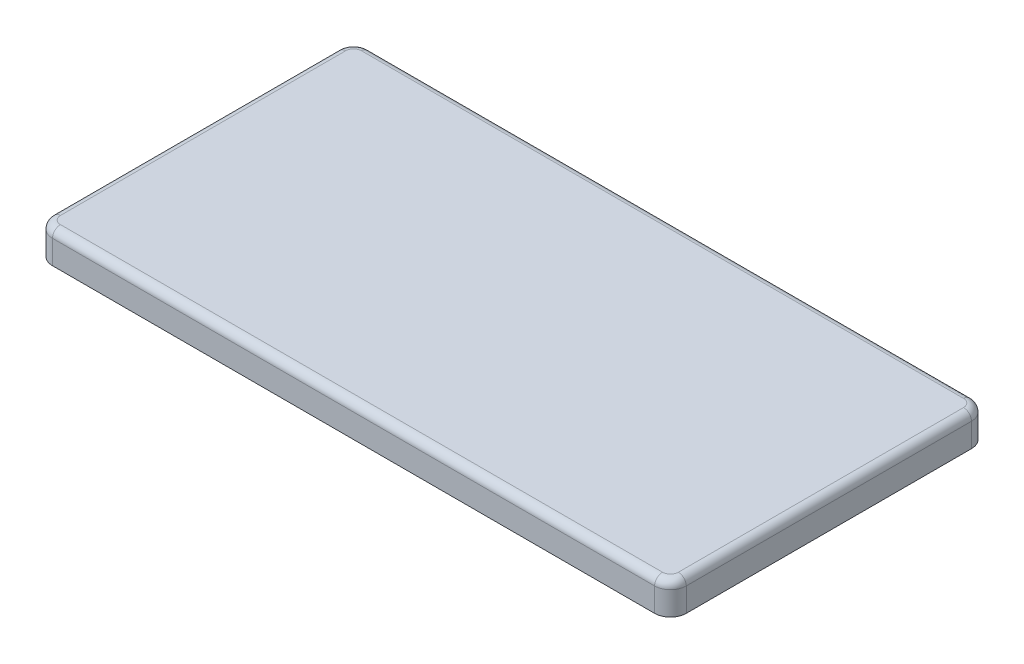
ISO-10303-21;
HEADER;
FILE_DESCRIPTION(('STEP AP214'),'2;1');
FILE_NAME('part.step','',(''),(''),'','','');
FILE_SCHEMA(('AUTOMOTIVE_DESIGN { 1 0 10303 214 1 1 1 1 }'));
ENDSEC;
DATA;
#1=APPLICATION_CONTEXT('core data for automotive mechanical design processes');
#2=APPLICATION_PROTOCOL_DEFINITION('international standard','automotive_design',2000,#1);
#3=PRODUCT_CONTEXT('',#1,'mechanical');
#4=PRODUCT('Part','Part','',(#3));
#5=PRODUCT_RELATED_PRODUCT_CATEGORY('part','',(#4));
#6=PRODUCT_DEFINITION_FORMATION('','',#4);
#7=PRODUCT_DEFINITION_CONTEXT('part definition',#1,'design');
#8=PRODUCT_DEFINITION('design','',#6,#7);
#9=PRODUCT_DEFINITION_SHAPE('','',#8);
#10=(LENGTH_UNIT() NAMED_UNIT(*) SI_UNIT(.MILLI.,.METRE.));
#11=(NAMED_UNIT(*) PLANE_ANGLE_UNIT() SI_UNIT($,.RADIAN.));
#12=(NAMED_UNIT(*) SI_UNIT($,.STERADIAN.) SOLID_ANGLE_UNIT());
#13=UNCERTAINTY_MEASURE_WITH_UNIT(LENGTH_MEASURE(1.E-05),#10,'distance_accuracy_value','');
#14=(GEOMETRIC_REPRESENTATION_CONTEXT(3) GLOBAL_UNCERTAINTY_ASSIGNED_CONTEXT((#13)) GLOBAL_UNIT_ASSIGNED_CONTEXT((#10,
#11,#12)) REPRESENTATION_CONTEXT('',''));
#15=CARTESIAN_POINT('',(0.,0.,0.));
#16=DIRECTION('',(0.,0.,1.));
#17=DIRECTION('',(1.,0.,0.));
#18=AXIS2_PLACEMENT_3D('',#15,#16,#17);
#19=CARTESIAN_POINT('',(-37.2,0.,17.2));
#20=DIRECTION('',(0.,-1.,0.));
#21=DIRECTION('',(0.,0.,-1.));
#22=AXIS2_PLACEMENT_3D('',#19,#20,#21);
#23=PLANE('',#22);
#24=DIRECTION('',(1.,0.,0.));
#25=VECTOR('',#24,1.);
#26=CARTESIAN_POINT('',(-22.15,0.,-3.15));
#27=LINE('',#26,#25);
#28=CARTESIAN_POINT('',(-22.15,0.,-3.15));
#29=VERTEX_POINT('',#28);
#30=CARTESIAN_POINT('',(-17.85,0.,-3.15));
#31=VERTEX_POINT('',#30);
#32=EDGE_CURVE('E282',#29,#31,#27,.T.);
#33=ORIENTED_EDGE('',*,*,#32,.F.);
#34=DIRECTION('',(0.,0.,-1.));
#35=VECTOR('',#34,1.);
#36=CARTESIAN_POINT('',(-22.15,0.,3.15));
#37=LINE('',#36,#35);
#38=CARTESIAN_POINT('',(-22.15,0.,3.15));
#39=VERTEX_POINT('',#38);
#40=EDGE_CURVE('E256',#39,#29,#37,.T.);
#41=ORIENTED_EDGE('',*,*,#40,.F.);
#42=DIRECTION('',(-1.,0.,0.));
#43=VECTOR('',#42,1.);
#44=CARTESIAN_POINT('',(-22.15,0.,3.15));
#45=LINE('',#44,#43);
#46=CARTESIAN_POINT('',(-17.85,0.,3.15));
#47=VERTEX_POINT('',#46);
#48=EDGE_CURVE('E288',#47,#39,#45,.T.);
#49=ORIENTED_EDGE('',*,*,#48,.F.);
#50=DIRECTION('',(0.,0.,1.));
#51=VECTOR('',#50,1.);
#52=CARTESIAN_POINT('',(-17.85,0.,3.15));
#53=LINE('',#52,#51);
#54=EDGE_CURVE('E285',#31,#47,#53,.T.);
#55=ORIENTED_EDGE('',*,*,#54,.F.);
#56=EDGE_LOOP('',(#33,#41,#49,#55));
#57=FACE_BOUND('',#56,.T.);
#58=CARTESIAN_POINT('',(-37.2,0.,17.2));
#59=DIRECTION('',(0.,-1.,0.));
#60=DIRECTION('',(0.,0.,-1.));
#61=AXIS2_PLACEMENT_3D('',#58,#59,#60);
#62=CIRCLE('',#61,0.800000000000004);
#63=CARTESIAN_POINT('',(-37.2,0.,18.));
#64=VERTEX_POINT('',#63);
#65=CARTESIAN_POINT('',(-38.,0.,17.2));
#66=VERTEX_POINT('',#65);
#67=EDGE_CURVE('E300',#64,#66,#62,.T.);
#68=ORIENTED_EDGE('',*,*,#67,.T.);
#69=DIRECTION('',(0.,0.,-1.));
#70=VECTOR('',#69,1.);
#71=CARTESIAN_POINT('',(-38.,0.,17.2));
#72=LINE('',#71,#70);
#73=CARTESIAN_POINT('',(-38.,0.,-17.2));
#74=VERTEX_POINT('',#73);
#75=EDGE_CURVE('E303',#66,#74,#72,.T.);
#76=ORIENTED_EDGE('',*,*,#75,.T.);
#77=CARTESIAN_POINT('',(-37.2,0.,-17.2));
#78=DIRECTION('',(0.,-1.,0.));
#79=DIRECTION('',(0.,0.,-1.));
#80=AXIS2_PLACEMENT_3D('',#77,#78,#79);
#81=CIRCLE('',#80,0.799999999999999);
#82=CARTESIAN_POINT('',(-37.2,0.,-18.));
#83=VERTEX_POINT('',#82);
#84=EDGE_CURVE('E307',#74,#83,#81,.T.);
#85=ORIENTED_EDGE('',*,*,#84,.T.);
#86=DIRECTION('',(1.,0.,0.));
#87=VECTOR('',#86,1.);
#88=CARTESIAN_POINT('',(-37.2,0.,-18.));
#89=LINE('',#88,#87);
#90=CARTESIAN_POINT('',(37.2,0.,-18.));
#91=VERTEX_POINT('',#90);
#92=EDGE_CURVE('E310',#83,#91,#89,.T.);
#93=ORIENTED_EDGE('',*,*,#92,.T.);
#94=CARTESIAN_POINT('',(37.2,0.,-17.2));
#95=DIRECTION('',(0.,-1.,0.));
#96=DIRECTION('',(0.,0.,-1.));
#97=AXIS2_PLACEMENT_3D('',#94,#95,#96);
#98=CIRCLE('',#97,0.799999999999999);
#99=CARTESIAN_POINT('',(38.,0.,-17.2));
#100=VERTEX_POINT('',#99);
#101=EDGE_CURVE('E313',#91,#100,#98,.T.);
#102=ORIENTED_EDGE('',*,*,#101,.T.);
#103=DIRECTION('',(0.,0.,1.));
#104=VECTOR('',#103,1.);
#105=CARTESIAN_POINT('',(38.,0.,17.2));
#106=LINE('',#105,#104);
#107=CARTESIAN_POINT('',(38.,0.,17.2));
#108=VERTEX_POINT('',#107);
#109=EDGE_CURVE('E316',#100,#108,#106,.T.);
#110=ORIENTED_EDGE('',*,*,#109,.T.);
#111=CARTESIAN_POINT('',(37.2,0.,17.2));
#112=DIRECTION('',(0.,-1.,0.));
#113=DIRECTION('',(0.,0.,-1.));
#114=AXIS2_PLACEMENT_3D('',#111,#112,#113);
#115=CIRCLE('',#114,0.799999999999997);
#116=CARTESIAN_POINT('',(37.2,0.,18.));
#117=VERTEX_POINT('',#116);
#118=EDGE_CURVE('E319',#108,#117,#115,.T.);
#119=ORIENTED_EDGE('',*,*,#118,.T.);
#120=DIRECTION('',(-1.,0.,0.));
#121=VECTOR('',#120,1.);
#122=CARTESIAN_POINT('',(-37.2,0.,18.));
#123=LINE('',#122,#121);
#124=EDGE_CURVE('E322',#117,#64,#123,.T.);
#125=ORIENTED_EDGE('',*,*,#124,.T.);
#126=EDGE_LOOP('',(#68,#76,#85,#93,#102,#110,#119,#125));
#127=FACE_BOUND('',#126,.T.);
#128=DIRECTION('',(1.,0.,0.));
#129=VECTOR('',#128,1.);
#130=CARTESIAN_POINT('',(17.85,0.,-3.15));
#131=LINE('',#130,#129);
#132=CARTESIAN_POINT('',(17.85,0.,-3.15));
#133=VERTEX_POINT('',#132);
#134=CARTESIAN_POINT('',(22.15,0.,-3.15));
#135=VERTEX_POINT('',#134);
#136=EDGE_CURVE('E250',#133,#135,#131,.T.);
#137=ORIENTED_EDGE('',*,*,#136,.F.);
#138=DIRECTION('',(0.,0.,-1.));
#139=VECTOR('',#138,1.);
#140=CARTESIAN_POINT('',(17.85,0.,3.15));
#141=LINE('',#140,#139);
#142=CARTESIAN_POINT('',(17.85,0.,3.15));
#143=VERTEX_POINT('',#142);
#144=EDGE_CURVE('E260',#143,#133,#141,.T.);
#145=ORIENTED_EDGE('',*,*,#144,.F.);
#146=DIRECTION('',(-1.,0.,0.));
#147=VECTOR('',#146,1.);
#148=CARTESIAN_POINT('',(17.85,0.,3.15));
#149=LINE('',#148,#147);
#150=CARTESIAN_POINT('',(22.15,0.,3.15));
#151=VERTEX_POINT('',#150);
#152=EDGE_CURVE('E272',#151,#143,#149,.T.);
#153=ORIENTED_EDGE('',*,*,#152,.F.);
#154=DIRECTION('',(0.,0.,1.));
#155=VECTOR('',#154,1.);
#156=CARTESIAN_POINT('',(22.15,0.,3.15));
#157=LINE('',#156,#155);
#158=EDGE_CURVE('E270',#135,#151,#157,.T.);
#159=ORIENTED_EDGE('',*,*,#158,.F.);
#160=EDGE_LOOP('',(#137,#145,#153,#159));
#161=FACE_BOUND('',#160,.T.);
#162=ADVANCED_FACE('F35',(#57,#127,#161),#23,.T.);
#163=CARTESIAN_POINT('',(-38.,2.,-18.));
#164=DIRECTION('',(0.,-1.,0.));
#165=DIRECTION('',(0.,0.,-1.));
#166=AXIS2_PLACEMENT_3D('',#163,#164,#165);
#167=CYLINDRICAL_SURFACE('',#166,2.);
#168=DIRECTION('',(0.,-1.,0.));
#169=VECTOR('',#168,1.);
#170=CARTESIAN_POINT('',(-40.,2.,-18.));
#171=LINE('',#170,#169);
#172=CARTESIAN_POINT('',(-40.,1.,-18.));
#173=VERTEX_POINT('',#172);
#174=CARTESIAN_POINT('',(-40.,-2.,-18.));
#175=VERTEX_POINT('',#174);
#176=EDGE_CURVE('E403',#173,#175,#171,.T.);
#177=ORIENTED_EDGE('',*,*,#176,.F.);
#178=CARTESIAN_POINT('',(-38.,1.,-18.));
#179=DIRECTION('',(0.,1.,0.));
#180=DIRECTION('',(0.,0.,1.));
#181=AXIS2_PLACEMENT_3D('',#178,#179,#180);
#182=CIRCLE('',#181,2.);
#183=CARTESIAN_POINT('',(-38.,1.,-20.));
#184=VERTEX_POINT('',#183);
#185=EDGE_CURVE('E427',#173,#184,#182,.F.);
#186=ORIENTED_EDGE('',*,*,#185,.T.);
#187=DIRECTION('',(0.,-1.,0.));
#188=VECTOR('',#187,1.);
#189=CARTESIAN_POINT('',(-38.,2.,-20.));
#190=LINE('',#189,#188);
#191=CARTESIAN_POINT('',(-38.,-2.,-20.));
#192=VERTEX_POINT('',#191);
#193=EDGE_CURVE('E389',#184,#192,#190,.T.);
#194=ORIENTED_EDGE('',*,*,#193,.T.);
#195=CARTESIAN_POINT('',(-38.,-2.,-18.));
#196=DIRECTION('',(0.,1.,0.));
#197=DIRECTION('',(0.,0.,1.));
#198=AXIS2_PLACEMENT_3D('',#195,#196,#197);
#199=CIRCLE('',#198,2.);
#200=EDGE_CURVE('E364',#192,#175,#199,.T.);
#201=ORIENTED_EDGE('',*,*,#200,.T.);
#202=EDGE_LOOP('',(#177,#186,#194,#201));
#203=FACE_BOUND('',#202,.T.);
#204=ADVANCED_FACE('F543',(#203),#167,.T.);
#205=CARTESIAN_POINT('',(-40.,2.,18.));
#206=DIRECTION('',(1.,0.,0.));
#207=DIRECTION('',(0.,0.,-1.));
#208=AXIS2_PLACEMENT_3D('',#205,#206,#207);
#209=PLANE('',#208);
#210=DIRECTION('',(0.,-1.,0.));
#211=VECTOR('',#210,1.);
#212=CARTESIAN_POINT('',(-40.,2.,18.));
#213=LINE('',#212,#211);
#214=CARTESIAN_POINT('',(-40.,1.,18.));
#215=VERTEX_POINT('',#214);
#216=CARTESIAN_POINT('',(-40.,-2.,18.));
#217=VERTEX_POINT('',#216);
#218=EDGE_CURVE('E401',#215,#217,#213,.T.);
#219=ORIENTED_EDGE('',*,*,#218,.F.);
#220=DIRECTION('',(0.,0.,1.));
#221=VECTOR('',#220,1.);
#222=CARTESIAN_POINT('',(-40.,1.,-18.));
#223=LINE('',#222,#221);
#224=EDGE_CURVE('E425',#215,#173,#223,.F.);
#225=ORIENTED_EDGE('',*,*,#224,.T.);
#226=ORIENTED_EDGE('',*,*,#176,.T.);
#227=DIRECTION('',(0.,0.,1.));
#228=VECTOR('',#227,1.);
#229=CARTESIAN_POINT('',(-40.,-2.,18.));
#230=LINE('',#229,#228);
#231=EDGE_CURVE('E367',#175,#217,#230,.T.);
#232=ORIENTED_EDGE('',*,*,#231,.T.);
#233=EDGE_LOOP('',(#219,#225,#226,#232));
#234=FACE_BOUND('',#233,.T.);
#235=ADVANCED_FACE('F549',(#234),#209,.F.);
#236=CARTESIAN_POINT('',(-38.,2.,18.));
#237=DIRECTION('',(0.,-1.,0.));
#238=DIRECTION('',(0.,0.,-1.));
#239=AXIS2_PLACEMENT_3D('',#236,#237,#238);
#240=CYLINDRICAL_SURFACE('',#239,2.);
#241=DIRECTION('',(0.,-1.,0.));
#242=VECTOR('',#241,1.);
#243=CARTESIAN_POINT('',(-38.,2.,20.));
#244=LINE('',#243,#242);
#245=CARTESIAN_POINT('',(-38.,1.,20.));
#246=VERTEX_POINT('',#245);
#247=CARTESIAN_POINT('',(-38.,-2.,20.));
#248=VERTEX_POINT('',#247);
#249=EDGE_CURVE('E399',#246,#248,#244,.T.);
#250=ORIENTED_EDGE('',*,*,#249,.F.);
#251=CARTESIAN_POINT('',(-38.,1.,18.));
#252=DIRECTION('',(0.,1.,0.));
#253=DIRECTION('',(0.,0.,1.));
#254=AXIS2_PLACEMENT_3D('',#251,#252,#253);
#255=CIRCLE('',#254,2.);
#256=EDGE_CURVE('E422',#246,#215,#255,.F.);
#257=ORIENTED_EDGE('',*,*,#256,.T.);
#258=ORIENTED_EDGE('',*,*,#218,.T.);
#259=CARTESIAN_POINT('',(-38.,-2.,18.));
#260=DIRECTION('',(0.,1.,0.));
#261=DIRECTION('',(0.,0.,1.));
#262=AXIS2_PLACEMENT_3D('',#259,#260,#261);
#263=CIRCLE('',#262,2.);
#264=EDGE_CURVE('E371',#217,#248,#263,.T.);
#265=ORIENTED_EDGE('',*,*,#264,.T.);
#266=EDGE_LOOP('',(#250,#257,#258,#265));
#267=FACE_BOUND('',#266,.T.);
#268=ADVANCED_FACE('F619',(#267),#240,.T.);
#269=CARTESIAN_POINT('',(-38.,2.,20.));
#270=DIRECTION('',(0.,0.,-1.));
#271=DIRECTION('',(-1.,0.,0.));
#272=AXIS2_PLACEMENT_3D('',#269,#270,#271);
#273=PLANE('',#272);
#274=DIRECTION('',(0.,-1.,0.));
#275=VECTOR('',#274,1.);
#276=CARTESIAN_POINT('',(38.,2.,20.));
#277=LINE('',#276,#275);
#278=CARTESIAN_POINT('',(38.,1.,20.));
#279=VERTEX_POINT('',#278);
#280=CARTESIAN_POINT('',(38.,-2.,20.));
#281=VERTEX_POINT('',#280);
#282=EDGE_CURVE('E397',#279,#281,#277,.T.);
#283=ORIENTED_EDGE('',*,*,#282,.F.);
#284=DIRECTION('',(1.,0.,0.));
#285=VECTOR('',#284,1.);
#286=CARTESIAN_POINT('',(-38.,1.,20.));
#287=LINE('',#286,#285);
#288=EDGE_CURVE('E437',#279,#246,#287,.F.);
#289=ORIENTED_EDGE('',*,*,#288,.T.);
#290=ORIENTED_EDGE('',*,*,#249,.T.);
#291=DIRECTION('',(1.,0.,0.));
#292=VECTOR('',#291,1.);
#293=CARTESIAN_POINT('',(-38.,-2.,20.));
#294=LINE('',#293,#292);
#295=EDGE_CURVE('E374',#248,#281,#294,.T.);
#296=ORIENTED_EDGE('',*,*,#295,.T.);
#297=EDGE_LOOP('',(#283,#289,#290,#296));
#298=FACE_BOUND('',#297,.T.);
#299=ADVANCED_FACE('F615',(#298),#273,.F.);
#300=CARTESIAN_POINT('',(38.,2.,18.));
#301=DIRECTION('',(0.,-1.,0.));
#302=DIRECTION('',(0.,0.,-1.));
#303=AXIS2_PLACEMENT_3D('',#300,#301,#302);
#304=CYLINDRICAL_SURFACE('',#303,2.);
#305=DIRECTION('',(0.,-1.,0.));
#306=VECTOR('',#305,1.);
#307=CARTESIAN_POINT('',(40.,2.,18.));
#308=LINE('',#307,#306);
#309=CARTESIAN_POINT('',(40.,1.,18.));
#310=VERTEX_POINT('',#309);
#311=CARTESIAN_POINT('',(40.,-2.,18.));
#312=VERTEX_POINT('',#311);
#313=EDGE_CURVE('E395',#310,#312,#308,.T.);
#314=ORIENTED_EDGE('',*,*,#313,.F.);
#315=CARTESIAN_POINT('',(38.,1.,18.));
#316=DIRECTION('',(0.,1.,0.));
#317=DIRECTION('',(0.,0.,1.));
#318=AXIS2_PLACEMENT_3D('',#315,#316,#317);
#319=CIRCLE('',#318,2.);
#320=EDGE_CURVE('E435',#310,#279,#319,.F.);
#321=ORIENTED_EDGE('',*,*,#320,.T.);
#322=ORIENTED_EDGE('',*,*,#282,.T.);
#323=CARTESIAN_POINT('',(38.,-2.,18.));
#324=DIRECTION('',(0.,1.,0.));
#325=DIRECTION('',(0.,0.,1.));
#326=AXIS2_PLACEMENT_3D('',#323,#324,#325);
#327=CIRCLE('',#326,2.);
#328=EDGE_CURVE('E377',#281,#312,#327,.T.);
#329=ORIENTED_EDGE('',*,*,#328,.T.);
#330=EDGE_LOOP('',(#314,#321,#322,#329));
#331=FACE_BOUND('',#330,.T.);
#332=ADVANCED_FACE('F611',(#331),#304,.T.);
#333=CARTESIAN_POINT('',(40.,2.,18.));
#334=DIRECTION('',(-1.,0.,0.));
#335=DIRECTION('',(0.,0.,1.));
#336=AXIS2_PLACEMENT_3D('',#333,#334,#335);
#337=PLANE('',#336);
#338=DIRECTION('',(0.,-1.,0.));
#339=VECTOR('',#338,1.);
#340=CARTESIAN_POINT('',(40.,2.,-18.));
#341=LINE('',#340,#339);
#342=CARTESIAN_POINT('',(40.,1.,-18.));
#343=VERTEX_POINT('',#342);
#344=CARTESIAN_POINT('',(40.,-2.,-18.));
#345=VERTEX_POINT('',#344);
#346=EDGE_CURVE('E393',#343,#345,#341,.T.);
#347=ORIENTED_EDGE('',*,*,#346,.F.);
#348=DIRECTION('',(0.,0.,-1.));
#349=VECTOR('',#348,1.);
#350=CARTESIAN_POINT('',(40.,1.,18.));
#351=LINE('',#350,#349);
#352=EDGE_CURVE('E433',#343,#310,#351,.F.);
#353=ORIENTED_EDGE('',*,*,#352,.T.);
#354=ORIENTED_EDGE('',*,*,#313,.T.);
#355=DIRECTION('',(0.,0.,-1.));
#356=VECTOR('',#355,1.);
#357=CARTESIAN_POINT('',(40.,-2.,18.));
#358=LINE('',#357,#356);
#359=EDGE_CURVE('E380',#312,#345,#358,.T.);
#360=ORIENTED_EDGE('',*,*,#359,.T.);
#361=EDGE_LOOP('',(#347,#353,#354,#360));
#362=FACE_BOUND('',#361,.T.);
#363=ADVANCED_FACE('F607',(#362),#337,.F.);
#364=CARTESIAN_POINT('',(38.,2.,-18.));
#365=DIRECTION('',(0.,-1.,0.));
#366=DIRECTION('',(0.,0.,-1.));
#367=AXIS2_PLACEMENT_3D('',#364,#365,#366);
#368=CYLINDRICAL_SURFACE('',#367,2.00000000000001);
#369=DIRECTION('',(0.,-1.,0.));
#370=VECTOR('',#369,1.);
#371=CARTESIAN_POINT('',(38.,2.,-20.));
#372=LINE('',#371,#370);
#373=CARTESIAN_POINT('',(38.,1.,-20.));
#374=VERTEX_POINT('',#373);
#375=CARTESIAN_POINT('',(38.,-2.,-20.));
#376=VERTEX_POINT('',#375);
#377=EDGE_CURVE('E391',#374,#376,#372,.T.);
#378=ORIENTED_EDGE('',*,*,#377,.F.);
#379=CARTESIAN_POINT('',(38.,1.,-18.));
#380=DIRECTION('',(0.,1.,0.));
#381=DIRECTION('',(0.,0.,1.));
#382=AXIS2_PLACEMENT_3D('',#379,#380,#381);
#383=CIRCLE('',#382,2.00000000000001);
#384=EDGE_CURVE('E431',#374,#343,#383,.F.);
#385=ORIENTED_EDGE('',*,*,#384,.T.);
#386=ORIENTED_EDGE('',*,*,#346,.T.);
#387=CARTESIAN_POINT('',(38.,-2.,-18.));
#388=DIRECTION('',(0.,1.,0.));
#389=DIRECTION('',(0.,0.,1.));
#390=AXIS2_PLACEMENT_3D('',#387,#388,#389);
#391=CIRCLE('',#390,2.00000000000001);
#392=EDGE_CURVE('E383',#345,#376,#391,.T.);
#393=ORIENTED_EDGE('',*,*,#392,.T.);
#394=EDGE_LOOP('',(#378,#385,#386,#393));
#395=FACE_BOUND('',#394,.T.);
#396=ADVANCED_FACE('F603',(#395),#368,.T.);
#397=CARTESIAN_POINT('',(-38.,2.,-20.));
#398=DIRECTION('',(0.,0.,1.));
#399=DIRECTION('',(1.,0.,0.));
#400=AXIS2_PLACEMENT_3D('',#397,#398,#399);
#401=PLANE('',#400);
#402=ORIENTED_EDGE('',*,*,#193,.F.);
#403=DIRECTION('',(-1.,0.,0.));
#404=VECTOR('',#403,1.);
#405=CARTESIAN_POINT('',(38.,1.,-20.));
#406=LINE('',#405,#404);
#407=EDGE_CURVE('E429',#184,#374,#406,.F.);
#408=ORIENTED_EDGE('',*,*,#407,.T.);
#409=ORIENTED_EDGE('',*,*,#377,.T.);
#410=DIRECTION('',(-1.,0.,0.));
#411=VECTOR('',#410,1.);
#412=CARTESIAN_POINT('',(-38.,-2.,-20.));
#413=LINE('',#412,#411);
#414=EDGE_CURVE('E386',#376,#192,#413,.T.);
#415=ORIENTED_EDGE('',*,*,#414,.T.);
#416=EDGE_LOOP('',(#402,#408,#409,#415));
#417=FACE_BOUND('',#416,.T.);
#418=ADVANCED_FACE('F595',(#417),#401,.F.);
#419=CARTESIAN_POINT('',(-38.,2.,-18.));
#420=DIRECTION('',(0.,1.,0.));
#421=DIRECTION('',(0.,0.,1.));
#422=AXIS2_PLACEMENT_3D('',#419,#420,#421);
#423=PLANE('',#422);
#424=DIRECTION('',(0.,0.,1.));
#425=VECTOR('',#424,1.);
#426=CARTESIAN_POINT('',(-39.,2.,18.));
#427=LINE('',#426,#425);
#428=CARTESIAN_POINT('',(-39.,2.,-18.));
#429=VERTEX_POINT('',#428);
#430=CARTESIAN_POINT('',(-39.,2.,18.));
#431=VERTEX_POINT('',#430);
#432=EDGE_CURVE('E417',#429,#431,#427,.T.);
#433=ORIENTED_EDGE('',*,*,#432,.T.);
#434=CARTESIAN_POINT('',(-38.,2.,18.));
#435=DIRECTION('',(0.,1.,0.));
#436=DIRECTION('',(0.,0.,1.));
#437=AXIS2_PLACEMENT_3D('',#434,#435,#436);
#438=CIRCLE('',#437,1.);
#439=CARTESIAN_POINT('',(-38.,2.,19.));
#440=VERTEX_POINT('',#439);
#441=EDGE_CURVE('E419',#431,#440,#438,.T.);
#442=ORIENTED_EDGE('',*,*,#441,.T.);
#443=DIRECTION('',(1.,0.,0.));
#444=VECTOR('',#443,1.);
#445=CARTESIAN_POINT('',(38.,2.,19.));
#446=LINE('',#445,#444);
#447=CARTESIAN_POINT('',(38.,2.,19.));
#448=VERTEX_POINT('',#447);
#449=EDGE_CURVE('E405',#440,#448,#446,.T.);
#450=ORIENTED_EDGE('',*,*,#449,.T.);
#451=CARTESIAN_POINT('',(38.,2.,18.));
#452=DIRECTION('',(0.,1.,0.));
#453=DIRECTION('',(0.,0.,1.));
#454=AXIS2_PLACEMENT_3D('',#451,#452,#453);
#455=CIRCLE('',#454,1.);
#456=CARTESIAN_POINT('',(39.,2.,18.));
#457=VERTEX_POINT('',#456);
#458=EDGE_CURVE('E407',#448,#457,#455,.T.);
#459=ORIENTED_EDGE('',*,*,#458,.T.);
#460=DIRECTION('',(0.,0.,-1.));
#461=VECTOR('',#460,1.);
#462=CARTESIAN_POINT('',(39.,2.,-18.));
#463=LINE('',#462,#461);
#464=CARTESIAN_POINT('',(39.,2.,-18.));
#465=VERTEX_POINT('',#464);
#466=EDGE_CURVE('E409',#457,#465,#463,.T.);
#467=ORIENTED_EDGE('',*,*,#466,.T.);
#468=CARTESIAN_POINT('',(38.,2.,-18.));
#469=DIRECTION('',(0.,1.,0.));
#470=DIRECTION('',(0.,0.,1.));
#471=AXIS2_PLACEMENT_3D('',#468,#469,#470);
#472=CIRCLE('',#471,1.00000000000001);
#473=CARTESIAN_POINT('',(38.,2.,-19.));
#474=VERTEX_POINT('',#473);
#475=EDGE_CURVE('E411',#465,#474,#472,.T.);
#476=ORIENTED_EDGE('',*,*,#475,.T.);
#477=DIRECTION('',(-1.,0.,0.));
#478=VECTOR('',#477,1.);
#479=CARTESIAN_POINT('',(-38.,2.,-19.));
#480=LINE('',#479,#478);
#481=CARTESIAN_POINT('',(-38.,2.,-19.));
#482=VERTEX_POINT('',#481);
#483=EDGE_CURVE('E413',#474,#482,#480,.T.);
#484=ORIENTED_EDGE('',*,*,#483,.T.);
#485=CARTESIAN_POINT('',(-38.,2.,-18.));
#486=DIRECTION('',(0.,1.,0.));
#487=DIRECTION('',(0.,0.,1.));
#488=AXIS2_PLACEMENT_3D('',#485,#486,#487);
#489=CIRCLE('',#488,1.);
#490=EDGE_CURVE('E415',#482,#429,#489,.T.);
#491=ORIENTED_EDGE('',*,*,#490,.T.);
#492=EDGE_LOOP('',(#433,#442,#450,#459,#467,#476,#484,#491));
#493=FACE_BOUND('',#492,.T.);
#494=ADVANCED_FACE('F591',(#493),#423,.T.);
#495=CARTESIAN_POINT('',(-38.,-2.,-18.));
#496=DIRECTION('',(0.,1.,0.));
#497=DIRECTION('',(0.,0.,1.));
#498=AXIS2_PLACEMENT_3D('',#495,#496,#497);
#499=PLANE('',#498);
#500=DIRECTION('',(0.,0.,-1.));
#501=VECTOR('',#500,1.);
#502=CARTESIAN_POINT('',(-38.,-2.,17.2));
#503=LINE('',#502,#501);
#504=CARTESIAN_POINT('',(-38.,-2.,17.2));
#505=VERTEX_POINT('',#504);
#506=CARTESIAN_POINT('',(-38.,-2.,-17.2));
#507=VERTEX_POINT('',#506);
#508=EDGE_CURVE('E327',#505,#507,#503,.T.);
#509=ORIENTED_EDGE('',*,*,#508,.F.);
#510=CARTESIAN_POINT('',(-37.2,-2.,17.2));
#511=DIRECTION('',(0.,-1.,0.));
#512=DIRECTION('',(0.,0.,-1.));
#513=AXIS2_PLACEMENT_3D('',#510,#511,#512);
#514=CIRCLE('',#513,0.800000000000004);
#515=CARTESIAN_POINT('',(-37.2,-2.,18.));
#516=VERTEX_POINT('',#515);
#517=EDGE_CURVE('E294',#516,#505,#514,.T.);
#518=ORIENTED_EDGE('',*,*,#517,.F.);
#519=DIRECTION('',(-1.,0.,0.));
#520=VECTOR('',#519,1.);
#521=CARTESIAN_POINT('',(-37.2,-2.,18.));
#522=LINE('',#521,#520);
#523=CARTESIAN_POINT('',(37.2,-2.,18.));
#524=VERTEX_POINT('',#523);
#525=EDGE_CURVE('E304',#524,#516,#522,.T.);
#526=ORIENTED_EDGE('',*,*,#525,.F.);
#527=CARTESIAN_POINT('',(37.2,-2.,17.2));
#528=DIRECTION('',(0.,-1.,0.));
#529=DIRECTION('',(0.,0.,-1.));
#530=AXIS2_PLACEMENT_3D('',#527,#528,#529);
#531=CIRCLE('',#530,0.799999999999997);
#532=CARTESIAN_POINT('',(38.,-2.,17.2));
#533=VERTEX_POINT('',#532);
#534=EDGE_CURVE('E342',#533,#524,#531,.T.);
#535=ORIENTED_EDGE('',*,*,#534,.F.);
#536=DIRECTION('',(0.,0.,1.));
#537=VECTOR('',#536,1.);
#538=CARTESIAN_POINT('',(38.,-2.,17.2));
#539=LINE('',#538,#537);
#540=CARTESIAN_POINT('',(38.,-2.,-17.2));
#541=VERTEX_POINT('',#540);
#542=EDGE_CURVE('E339',#541,#533,#539,.T.);
#543=ORIENTED_EDGE('',*,*,#542,.F.);
#544=CARTESIAN_POINT('',(37.2,-2.,-17.2));
#545=DIRECTION('',(0.,-1.,0.));
#546=DIRECTION('',(0.,0.,-1.));
#547=AXIS2_PLACEMENT_3D('',#544,#545,#546);
#548=CIRCLE('',#547,0.799999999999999);
#549=CARTESIAN_POINT('',(37.2,-2.,-18.));
#550=VERTEX_POINT('',#549);
#551=EDGE_CURVE('E336',#550,#541,#548,.T.);
#552=ORIENTED_EDGE('',*,*,#551,.F.);
#553=DIRECTION('',(1.,0.,0.));
#554=VECTOR('',#553,1.);
#555=CARTESIAN_POINT('',(-37.2,-2.,-18.));
#556=LINE('',#555,#554);
#557=CARTESIAN_POINT('',(-37.2,-2.,-18.));
#558=VERTEX_POINT('',#557);
#559=EDGE_CURVE('E333',#558,#550,#556,.T.);
#560=ORIENTED_EDGE('',*,*,#559,.F.);
#561=CARTESIAN_POINT('',(-37.2,-2.,-17.2));
#562=DIRECTION('',(0.,-1.,0.));
#563=DIRECTION('',(0.,0.,-1.));
#564=AXIS2_PLACEMENT_3D('',#561,#562,#563);
#565=CIRCLE('',#564,0.799999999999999);
#566=EDGE_CURVE('E330',#507,#558,#565,.T.);
#567=ORIENTED_EDGE('',*,*,#566,.F.);
#568=EDGE_LOOP('',(#509,#518,#526,#535,#543,#552,#560,#567));
#569=FACE_BOUND('',#568,.T.);
#570=ORIENTED_EDGE('',*,*,#200,.F.);
#571=ORIENTED_EDGE('',*,*,#414,.F.);
#572=ORIENTED_EDGE('',*,*,#392,.F.);
#573=ORIENTED_EDGE('',*,*,#359,.F.);
#574=ORIENTED_EDGE('',*,*,#328,.F.);
#575=ORIENTED_EDGE('',*,*,#295,.F.);
#576=ORIENTED_EDGE('',*,*,#264,.F.);
#577=ORIENTED_EDGE('',*,*,#231,.F.);
#578=EDGE_LOOP('',(#570,#571,#572,#573,#574,#575,#576,#577));
#579=FACE_BOUND('',#578,.T.);
#580=ADVANCED_FACE('F594',(#569,#579),#499,.F.);
#581=CARTESIAN_POINT('',(38.,1.,-18.));
#582=DIRECTION('',(0.,1.,0.));
#583=DIRECTION('',(0.,0.,1.));
#584=AXIS2_PLACEMENT_3D('',#581,#582,#583);
#585=TOROIDAL_SURFACE('',#584,1.00000000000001,1.);
#586=CARTESIAN_POINT('',(39.,1.,-18.));
#587=DIRECTION('',(0.,0.,1.));
#588=DIRECTION('',(1.,0.,0.));
#589=AXIS2_PLACEMENT_3D('',#586,#587,#588);
#590=CIRCLE('',#589,1.);
#591=EDGE_CURVE('E455',#343,#465,#590,.T.);
#592=ORIENTED_EDGE('',*,*,#591,.F.);
#593=ORIENTED_EDGE('',*,*,#384,.F.);
#594=CARTESIAN_POINT('',(38.,1.,-19.));
#595=DIRECTION('',(-1.,0.,0.));
#596=DIRECTION('',(0.,0.,1.));
#597=AXIS2_PLACEMENT_3D('',#594,#595,#596);
#598=CIRCLE('',#597,1.);
#599=EDGE_CURVE('E368',#474,#374,#598,.T.);
#600=ORIENTED_EDGE('',*,*,#599,.F.);
#601=ORIENTED_EDGE('',*,*,#475,.F.);
#602=EDGE_LOOP('',(#592,#593,#600,#601));
#603=FACE_BOUND('',#602,.T.);
#604=ADVANCED_FACE('F599',(#603),#585,.T.);
#605=CARTESIAN_POINT('',(-38.,1.,-19.));
#606=DIRECTION('',(1.,0.,0.));
#607=DIRECTION('',(0.,0.,-1.));
#608=AXIS2_PLACEMENT_3D('',#605,#606,#607);
#609=CYLINDRICAL_SURFACE('',#608,1.);
#610=ORIENTED_EDGE('',*,*,#599,.T.);
#611=ORIENTED_EDGE('',*,*,#407,.F.);
#612=CARTESIAN_POINT('',(-38.,1.,-19.));
#613=DIRECTION('',(-1.,0.,0.));
#614=DIRECTION('',(0.,0.,1.));
#615=AXIS2_PLACEMENT_3D('',#612,#613,#614);
#616=CIRCLE('',#615,1.);
#617=EDGE_CURVE('E452',#482,#184,#616,.T.);
#618=ORIENTED_EDGE('',*,*,#617,.F.);
#619=ORIENTED_EDGE('',*,*,#483,.F.);
#620=EDGE_LOOP('',(#610,#611,#618,#619));
#621=FACE_BOUND('',#620,.T.);
#622=ADVANCED_FACE('F649',(#621),#609,.T.);
#623=CARTESIAN_POINT('',(39.,1.,-18.));
#624=DIRECTION('',(0.,0.,1.));
#625=DIRECTION('',(1.,0.,0.));
#626=AXIS2_PLACEMENT_3D('',#623,#624,#625);
#627=CYLINDRICAL_SURFACE('',#626,1.);
#628=ORIENTED_EDGE('',*,*,#591,.T.);
#629=ORIENTED_EDGE('',*,*,#466,.F.);
#630=CARTESIAN_POINT('',(39.,1.,18.));
#631=DIRECTION('',(0.,0.,1.));
#632=DIRECTION('',(1.,0.,0.));
#633=AXIS2_PLACEMENT_3D('',#630,#631,#632);
#634=CIRCLE('',#633,1.);
#635=EDGE_CURVE('E449',#310,#457,#634,.T.);
#636=ORIENTED_EDGE('',*,*,#635,.F.);
#637=ORIENTED_EDGE('',*,*,#352,.F.);
#638=EDGE_LOOP('',(#628,#629,#636,#637));
#639=FACE_BOUND('',#638,.T.);
#640=ADVANCED_FACE('F645',(#639),#627,.T.);
#641=CARTESIAN_POINT('',(-38.,1.,-18.));
#642=DIRECTION('',(0.,1.,0.));
#643=DIRECTION('',(0.,0.,1.));
#644=AXIS2_PLACEMENT_3D('',#641,#642,#643);
#645=TOROIDAL_SURFACE('',#644,1.,1.);
#646=ORIENTED_EDGE('',*,*,#617,.T.);
#647=ORIENTED_EDGE('',*,*,#185,.F.);
#648=CARTESIAN_POINT('',(-39.,1.,-18.));
#649=DIRECTION('',(0.,0.,1.));
#650=DIRECTION('',(1.,0.,0.));
#651=AXIS2_PLACEMENT_3D('',#648,#649,#650);
#652=CIRCLE('',#651,1.);
#653=EDGE_CURVE('E446',#429,#173,#652,.T.);
#654=ORIENTED_EDGE('',*,*,#653,.F.);
#655=ORIENTED_EDGE('',*,*,#490,.F.);
#656=EDGE_LOOP('',(#646,#647,#654,#655));
#657=FACE_BOUND('',#656,.T.);
#658=ADVANCED_FACE('F641',(#657),#645,.T.);
#659=CARTESIAN_POINT('',(38.,1.,18.));
#660=DIRECTION('',(0.,1.,0.));
#661=DIRECTION('',(0.,0.,1.));
#662=AXIS2_PLACEMENT_3D('',#659,#660,#661);
#663=DEGENERATE_TOROIDAL_SURFACE('',#662,1.,1.,.T.);
#664=ORIENTED_EDGE('',*,*,#635,.T.);
#665=ORIENTED_EDGE('',*,*,#458,.F.);
#666=CARTESIAN_POINT('',(38.,1.,19.));
#667=DIRECTION('',(-1.,0.,0.));
#668=DIRECTION('',(0.,0.,1.));
#669=AXIS2_PLACEMENT_3D('',#666,#667,#668);
#670=CIRCLE('',#669,1.);
#671=EDGE_CURVE('E443',#279,#448,#670,.T.);
#672=ORIENTED_EDGE('',*,*,#671,.F.);
#673=ORIENTED_EDGE('',*,*,#320,.F.);
#674=EDGE_LOOP('',(#664,#665,#672,#673));
#675=FACE_BOUND('',#674,.T.);
#676=ADVANCED_FACE('F637',(#675),#663,.T.);
#677=CARTESIAN_POINT('',(-39.,1.,-18.));
#678=DIRECTION('',(0.,0.,-1.));
#679=DIRECTION('',(-1.,0.,0.));
#680=AXIS2_PLACEMENT_3D('',#677,#678,#679);
#681=CYLINDRICAL_SURFACE('',#680,1.);
#682=ORIENTED_EDGE('',*,*,#653,.T.);
#683=ORIENTED_EDGE('',*,*,#224,.F.);
#684=CARTESIAN_POINT('',(-39.,1.,18.));
#685=DIRECTION('',(0.,0.,1.));
#686=DIRECTION('',(1.,0.,0.));
#687=AXIS2_PLACEMENT_3D('',#684,#685,#686);
#688=CIRCLE('',#687,1.);
#689=EDGE_CURVE('E441',#431,#215,#688,.T.);
#690=ORIENTED_EDGE('',*,*,#689,.F.);
#691=ORIENTED_EDGE('',*,*,#432,.F.);
#692=EDGE_LOOP('',(#682,#683,#690,#691));
#693=FACE_BOUND('',#692,.T.);
#694=ADVANCED_FACE('F633',(#693),#681,.T.);
#695=CARTESIAN_POINT('',(-38.,1.,19.));
#696=DIRECTION('',(-1.,0.,0.));
#697=DIRECTION('',(0.,0.,1.));
#698=AXIS2_PLACEMENT_3D('',#695,#696,#697);
#699=CYLINDRICAL_SURFACE('',#698,1.);
#700=ORIENTED_EDGE('',*,*,#671,.T.);
#701=ORIENTED_EDGE('',*,*,#449,.F.);
#702=CARTESIAN_POINT('',(-38.,1.,19.));
#703=DIRECTION('',(-1.,0.,0.));
#704=DIRECTION('',(0.,0.,1.));
#705=AXIS2_PLACEMENT_3D('',#702,#703,#704);
#706=CIRCLE('',#705,1.);
#707=EDGE_CURVE('E349',#246,#440,#706,.T.);
#708=ORIENTED_EDGE('',*,*,#707,.F.);
#709=ORIENTED_EDGE('',*,*,#288,.F.);
#710=EDGE_LOOP('',(#700,#701,#708,#709));
#711=FACE_BOUND('',#710,.T.);
#712=ADVANCED_FACE('F629',(#711),#699,.T.);
#713=CARTESIAN_POINT('',(-38.,1.,18.));
#714=DIRECTION('',(0.,1.,0.));
#715=DIRECTION('',(0.,0.,1.));
#716=AXIS2_PLACEMENT_3D('',#713,#714,#715);
#717=DEGENERATE_TOROIDAL_SURFACE('',#716,1.,1.,.T.);
#718=ORIENTED_EDGE('',*,*,#689,.T.);
#719=ORIENTED_EDGE('',*,*,#256,.F.);
#720=ORIENTED_EDGE('',*,*,#707,.T.);
#721=ORIENTED_EDGE('',*,*,#441,.F.);
#722=EDGE_LOOP('',(#718,#719,#720,#721));
#723=FACE_BOUND('',#722,.T.);
#724=ADVANCED_FACE('F589',(#723),#717,.T.);
#725=CARTESIAN_POINT('',(-37.2,0.,17.2));
#726=DIRECTION('',(0.,-1.,0.));
#727=DIRECTION('',(0.,0.,-1.));
#728=AXIS2_PLACEMENT_3D('',#725,#726,#727);
#729=CYLINDRICAL_SURFACE('',#728,0.800000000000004);
#730=ORIENTED_EDGE('',*,*,#517,.T.);
#731=DIRECTION('',(0.,-1.,0.));
#732=VECTOR('',#731,1.);
#733=CARTESIAN_POINT('',(-38.,0.,17.2));
#734=LINE('',#733,#732);
#735=EDGE_CURVE('E325',#66,#505,#734,.T.);
#736=ORIENTED_EDGE('',*,*,#735,.F.);
#737=ORIENTED_EDGE('',*,*,#67,.F.);
#738=DIRECTION('',(0.,-1.,0.));
#739=VECTOR('',#738,1.);
#740=CARTESIAN_POINT('',(-37.2,0.,18.));
#741=LINE('',#740,#739);
#742=EDGE_CURVE('E347',#64,#516,#741,.T.);
#743=ORIENTED_EDGE('',*,*,#742,.T.);
#744=EDGE_LOOP('',(#730,#736,#737,#743));
#745=FACE_BOUND('',#744,.T.);
#746=ADVANCED_FACE('F562',(#745),#729,.F.);
#747=CARTESIAN_POINT('',(-37.2,0.,18.));
#748=DIRECTION('',(0.,0.,1.));
#749=DIRECTION('',(1.,0.,0.));
#750=AXIS2_PLACEMENT_3D('',#747,#748,#749);
#751=PLANE('',#750);
#752=ORIENTED_EDGE('',*,*,#525,.T.);
#753=ORIENTED_EDGE('',*,*,#742,.F.);
#754=ORIENTED_EDGE('',*,*,#124,.F.);
#755=DIRECTION('',(0.,-1.,0.));
#756=VECTOR('',#755,1.);
#757=CARTESIAN_POINT('',(37.2,0.,18.));
#758=LINE('',#757,#756);
#759=EDGE_CURVE('E350',#117,#524,#758,.T.);
#760=ORIENTED_EDGE('',*,*,#759,.T.);
#761=EDGE_LOOP('',(#752,#753,#754,#760));
#762=FACE_BOUND('',#761,.T.);
#763=ADVANCED_FACE('F558',(#762),#751,.F.);
#764=CARTESIAN_POINT('',(37.2,0.,17.2));
#765=DIRECTION('',(0.,-1.,0.));
#766=DIRECTION('',(0.,0.,-1.));
#767=AXIS2_PLACEMENT_3D('',#764,#765,#766);
#768=CYLINDRICAL_SURFACE('',#767,0.799999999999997);
#769=ORIENTED_EDGE('',*,*,#534,.T.);
#770=ORIENTED_EDGE('',*,*,#759,.F.);
#771=ORIENTED_EDGE('',*,*,#118,.F.);
#772=DIRECTION('',(0.,-1.,0.));
#773=VECTOR('',#772,1.);
#774=CARTESIAN_POINT('',(38.,0.,17.2));
#775=LINE('',#774,#773);
#776=EDGE_CURVE('E352',#108,#533,#775,.T.);
#777=ORIENTED_EDGE('',*,*,#776,.T.);
#778=EDGE_LOOP('',(#769,#770,#771,#777));
#779=FACE_BOUND('',#778,.T.);
#780=ADVANCED_FACE('F561',(#779),#768,.F.);
#781=CARTESIAN_POINT('',(38.,0.,17.2));
#782=DIRECTION('',(1.,0.,0.));
#783=DIRECTION('',(0.,0.,-1.));
#784=AXIS2_PLACEMENT_3D('',#781,#782,#783);
#785=PLANE('',#784);
#786=ORIENTED_EDGE('',*,*,#542,.T.);
#787=ORIENTED_EDGE('',*,*,#776,.F.);
#788=ORIENTED_EDGE('',*,*,#109,.F.);
#789=DIRECTION('',(0.,-1.,0.));
#790=VECTOR('',#789,1.);
#791=CARTESIAN_POINT('',(38.,0.,-17.2));
#792=LINE('',#791,#790);
#793=EDGE_CURVE('E354',#100,#541,#792,.T.);
#794=ORIENTED_EDGE('',*,*,#793,.T.);
#795=EDGE_LOOP('',(#786,#787,#788,#794));
#796=FACE_BOUND('',#795,.T.);
#797=ADVANCED_FACE('F566',(#796),#785,.F.);
#798=CARTESIAN_POINT('',(37.2,0.,-17.2));
#799=DIRECTION('',(0.,-1.,0.));
#800=DIRECTION('',(0.,0.,-1.));
#801=AXIS2_PLACEMENT_3D('',#798,#799,#800);
#802=CYLINDRICAL_SURFACE('',#801,0.799999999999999);
#803=ORIENTED_EDGE('',*,*,#551,.T.);
#804=ORIENTED_EDGE('',*,*,#793,.F.);
#805=ORIENTED_EDGE('',*,*,#101,.F.);
#806=DIRECTION('',(0.,-1.,0.));
#807=VECTOR('',#806,1.);
#808=CARTESIAN_POINT('',(37.2,0.,-18.));
#809=LINE('',#808,#807);
#810=EDGE_CURVE('E356',#91,#550,#809,.T.);
#811=ORIENTED_EDGE('',*,*,#810,.T.);
#812=EDGE_LOOP('',(#803,#804,#805,#811));
#813=FACE_BOUND('',#812,.T.);
#814=ADVANCED_FACE('F570',(#813),#802,.F.);
#815=CARTESIAN_POINT('',(-37.2,0.,-18.));
#816=DIRECTION('',(0.,0.,-1.));
#817=DIRECTION('',(-1.,0.,0.));
#818=AXIS2_PLACEMENT_3D('',#815,#816,#817);
#819=PLANE('',#818);
#820=ORIENTED_EDGE('',*,*,#559,.T.);
#821=ORIENTED_EDGE('',*,*,#810,.F.);
#822=ORIENTED_EDGE('',*,*,#92,.F.);
#823=DIRECTION('',(0.,-1.,0.));
#824=VECTOR('',#823,1.);
#825=CARTESIAN_POINT('',(-37.2,0.,-18.));
#826=LINE('',#825,#824);
#827=EDGE_CURVE('E358',#83,#558,#826,.T.);
#828=ORIENTED_EDGE('',*,*,#827,.T.);
#829=EDGE_LOOP('',(#820,#821,#822,#828));
#830=FACE_BOUND('',#829,.T.);
#831=ADVANCED_FACE('F574',(#830),#819,.F.);
#832=CARTESIAN_POINT('',(-37.2,0.,-17.2));
#833=DIRECTION('',(0.,-1.,0.));
#834=DIRECTION('',(0.,0.,-1.));
#835=AXIS2_PLACEMENT_3D('',#832,#833,#834);
#836=CYLINDRICAL_SURFACE('',#835,0.799999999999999);
#837=ORIENTED_EDGE('',*,*,#566,.T.);
#838=ORIENTED_EDGE('',*,*,#827,.F.);
#839=ORIENTED_EDGE('',*,*,#84,.F.);
#840=DIRECTION('',(0.,-1.,0.));
#841=VECTOR('',#840,1.);
#842=CARTESIAN_POINT('',(-38.,0.,-17.2));
#843=LINE('',#842,#841);
#844=EDGE_CURVE('E360',#74,#507,#843,.T.);
#845=ORIENTED_EDGE('',*,*,#844,.T.);
#846=EDGE_LOOP('',(#837,#838,#839,#845));
#847=FACE_BOUND('',#846,.T.);
#848=ADVANCED_FACE('F578',(#847),#836,.F.);
#849=CARTESIAN_POINT('',(-38.,0.,17.2));
#850=DIRECTION('',(-1.,0.,0.));
#851=DIRECTION('',(0.,0.,1.));
#852=AXIS2_PLACEMENT_3D('',#849,#850,#851);
#853=PLANE('',#852);
#854=ORIENTED_EDGE('',*,*,#508,.T.);
#855=ORIENTED_EDGE('',*,*,#844,.F.);
#856=ORIENTED_EDGE('',*,*,#75,.F.);
#857=ORIENTED_EDGE('',*,*,#735,.T.);
#858=EDGE_LOOP('',(#854,#855,#856,#857));
#859=FACE_BOUND('',#858,.T.);
#860=ADVANCED_FACE('F582',(#859),#853,.F.);
#861=CARTESIAN_POINT('',(-22.15,0.,3.15));
#862=DIRECTION('',(-0.999961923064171,-0.00872653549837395,0.));
#863=DIRECTION('',(0.00872653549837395,-0.999961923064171,0.));
#864=AXIS2_PLACEMENT_3D('',#861,#862,#863);
#865=PLANE('',#864);
#866=DIRECTION('',(-0.00872620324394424,0.99992385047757,-0.00872620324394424));
#867=VECTOR('',#866,1.);
#868=CARTESIAN_POINT('',(-22.15,0.,-3.15));
#869=LINE('',#868,#867);
#870=CARTESIAN_POINT('',(-22.060925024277,-10.2069812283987,-3.06092502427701));
#871=VERTEX_POINT('',#870);
#872=EDGE_CURVE('E292',#871,#29,#869,.T.);
#873=ORIENTED_EDGE('',*,*,#872,.F.);
#874=DIRECTION('',(0.,0.,-1.));
#875=VECTOR('',#874,1.);
#876=CARTESIAN_POINT('',(-22.060925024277,-10.2069812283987,3.05400445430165));
#877=LINE('',#876,#875);
#878=CARTESIAN_POINT('',(-22.060925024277,-10.2069812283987,3.06092502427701));
#879=VERTEX_POINT('',#878);
#880=EDGE_CURVE('E11',#871,#879,#877,.F.);
#881=ORIENTED_EDGE('',*,*,#880,.T.);
#882=DIRECTION('',(-0.00872620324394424,0.99992385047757,0.00872620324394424));
#883=VECTOR('',#882,1.);
#884=CARTESIAN_POINT('',(-22.15,0.,3.15));
#885=LINE('',#884,#883);
#886=EDGE_CURVE('E291',#879,#39,#885,.T.);
#887=ORIENTED_EDGE('',*,*,#886,.T.);
#888=ORIENTED_EDGE('',*,*,#40,.T.);
#889=EDGE_LOOP('',(#873,#881,#887,#888));
#890=FACE_BOUND('',#889,.T.);
#891=ADVANCED_FACE('F520',(#890),#865,.T.);
#892=CARTESIAN_POINT('',(-22.15,0.,-3.15));
#893=DIRECTION('',(0.,-0.00872653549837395,-0.999961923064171));
#894=DIRECTION('',(0.,0.999961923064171,-0.00872653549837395));
#895=AXIS2_PLACEMENT_3D('',#892,#893,#894);
#896=PLANE('',#895);
#897=DIRECTION('',(0.00872620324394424,0.99992385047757,-0.00872620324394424));
#898=VECTOR('',#897,1.);
#899=CARTESIAN_POINT('',(-17.8504797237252,-0.0549708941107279,-3.14952027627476));
#900=LINE('',#899,#898);
#901=CARTESIAN_POINT('',(-17.939074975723,-10.2069812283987,-3.06092502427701));
#902=VERTEX_POINT('',#901);
#903=EDGE_CURVE('E295',#902,#31,#900,.T.);
#904=ORIENTED_EDGE('',*,*,#903,.F.);
#905=DIRECTION('',(1.,0.,0.));
#906=VECTOR('',#905,1.);
#907=CARTESIAN_POINT('',(-22.0540044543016,-10.2069812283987,-3.06092502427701));
#908=LINE('',#907,#906);
#909=EDGE_CURVE('E44',#902,#871,#908,.F.);
#910=ORIENTED_EDGE('',*,*,#909,.T.);
#911=ORIENTED_EDGE('',*,*,#872,.T.);
#912=ORIENTED_EDGE('',*,*,#32,.T.);
#913=EDGE_LOOP('',(#904,#910,#911,#912));
#914=FACE_BOUND('',#913,.T.);
#915=ADVANCED_FACE('F556',(#914),#896,.T.);
#916=CARTESIAN_POINT('',(-17.85,0.,3.15));
#917=DIRECTION('',(0.999961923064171,-0.00872653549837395,0.));
#918=DIRECTION('',(0.00872653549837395,0.999961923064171,0.));
#919=AXIS2_PLACEMENT_3D('',#916,#917,#918);
#920=PLANE('',#919);
#921=DIRECTION('',(0.00872620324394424,0.99992385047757,0.00872620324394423));
#922=VECTOR('',#921,1.);
#923=CARTESIAN_POINT('',(-17.8503274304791,-0.0375198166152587,3.14967256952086));
#924=LINE('',#923,#922);
#925=CARTESIAN_POINT('',(-17.939074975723,-10.2069812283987,3.06092502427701));
#926=VERTEX_POINT('',#925);
#927=EDGE_CURVE('E297',#926,#47,#924,.T.);
#928=ORIENTED_EDGE('',*,*,#927,.F.);
#929=DIRECTION('',(0.,0.,1.));
#930=VECTOR('',#929,1.);
#931=CARTESIAN_POINT('',(-17.939074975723,-10.2069812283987,-3.05400445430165));
#932=LINE('',#931,#930);
#933=EDGE_CURVE('E59',#926,#902,#932,.F.);
#934=ORIENTED_EDGE('',*,*,#933,.T.);
#935=ORIENTED_EDGE('',*,*,#903,.T.);
#936=ORIENTED_EDGE('',*,*,#54,.T.);
#937=EDGE_LOOP('',(#928,#934,#935,#936));
#938=FACE_BOUND('',#937,.T.);
#939=ADVANCED_FACE('F538',(#938),#920,.T.);
#940=CARTESIAN_POINT('',(-22.15,0.,3.15));
#941=DIRECTION('',(0.,-0.00872653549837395,0.999961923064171));
#942=DIRECTION('',(0.,-0.999961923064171,-0.00872653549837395));
#943=AXIS2_PLACEMENT_3D('',#940,#941,#942);
#944=PLANE('',#943);
#945=ORIENTED_EDGE('',*,*,#886,.F.);
#946=DIRECTION('',(-1.,0.,0.));
#947=VECTOR('',#946,1.);
#948=CARTESIAN_POINT('',(-17.9459955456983,-10.2069812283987,3.06092502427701));
#949=LINE('',#948,#947);
#950=EDGE_CURVE('E485',#879,#926,#949,.F.);
#951=ORIENTED_EDGE('',*,*,#950,.T.);
#952=ORIENTED_EDGE('',*,*,#927,.T.);
#953=ORIENTED_EDGE('',*,*,#48,.T.);
#954=EDGE_LOOP('',(#945,#951,#952,#953));
#955=FACE_BOUND('',#954,.T.);
#956=ADVANCED_FACE('F523',(#955),#944,.T.);
#957=CARTESIAN_POINT('',(-22.15,-11.,-3.15));
#958=DIRECTION('',(0.,-1.,0.));
#959=DIRECTION('',(0.,0.,-1.));
#960=AXIS2_PLACEMENT_3D('',#957,#958,#959);
#961=PLANE('',#960);
#962=DIRECTION('',(0.,0.,-1.));
#963=VECTOR('',#962,1.);
#964=CARTESIAN_POINT('',(-18.7390445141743,-11.,3.05400445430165));
#965=LINE('',#964,#963);
#966=CARTESIAN_POINT('',(-18.7390445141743,-11.,-2.26095548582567));
#967=VERTEX_POINT('',#966);
#968=CARTESIAN_POINT('',(-18.7390445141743,-11.,2.26095548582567));
#969=VERTEX_POINT('',#968);
#970=EDGE_CURVE('E480',#967,#969,#965,.F.);
#971=ORIENTED_EDGE('',*,*,#970,.T.);
#972=DIRECTION('',(1.,0.,0.));
#973=VECTOR('',#972,1.);
#974=CARTESIAN_POINT('',(-22.0540044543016,-11.,2.26095548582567));
#975=LINE('',#974,#973);
#976=CARTESIAN_POINT('',(-21.2609554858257,-11.,2.26095548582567));
#977=VERTEX_POINT('',#976);
#978=EDGE_CURVE('E482',#969,#977,#975,.F.);
#979=ORIENTED_EDGE('',*,*,#978,.T.);
#980=DIRECTION('',(0.,0.,1.));
#981=VECTOR('',#980,1.);
#982=CARTESIAN_POINT('',(-21.2609554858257,-11.,-3.05400445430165));
#983=LINE('',#982,#981);
#984=CARTESIAN_POINT('',(-21.2609554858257,-11.,-2.26095548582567));
#985=VERTEX_POINT('',#984);
#986=EDGE_CURVE('E476',#977,#985,#983,.F.);
#987=ORIENTED_EDGE('',*,*,#986,.T.);
#988=DIRECTION('',(-1.,0.,0.));
#989=VECTOR('',#988,1.);
#990=CARTESIAN_POINT('',(-17.9459955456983,-11.,-2.26095548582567));
#991=LINE('',#990,#989);
#992=EDGE_CURVE('E478',#985,#967,#991,.F.);
#993=ORIENTED_EDGE('',*,*,#992,.T.);
#994=EDGE_LOOP('',(#971,#979,#987,#993));
#995=FACE_BOUND('',#994,.T.);
#996=ADVANCED_FACE('F530',(#995),#961,.T.);
#997=CARTESIAN_POINT('',(17.85,0.,3.15));
#998=DIRECTION('',(-0.999961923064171,-0.00872653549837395,0.));
#999=DIRECTION('',(0.00872653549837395,-0.999961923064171,0.));
#1000=AXIS2_PLACEMENT_3D('',#997,#998,#999);
#1001=PLANE('',#1000);
#1002=DIRECTION('',(-0.00872620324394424,0.99992385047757,-0.00872620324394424));
#1003=VECTOR('',#1002,1.);
#1004=CARTESIAN_POINT('',(17.85,0.,-3.15));
#1005=LINE('',#1004,#1003);
#1006=CARTESIAN_POINT('',(17.939074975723,-10.2069812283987,-3.06092502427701));
#1007=VERTEX_POINT('',#1006);
#1008=EDGE_CURVE('E245',#1007,#133,#1005,.T.);
#1009=ORIENTED_EDGE('',*,*,#1008,.F.);
#1010=DIRECTION('',(0.,0.,-1.));
#1011=VECTOR('',#1010,1.);
#1012=CARTESIAN_POINT('',(17.939074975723,-10.2069812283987,3.05400445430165));
#1013=LINE('',#1012,#1011);
#1014=CARTESIAN_POINT('',(17.939074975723,-10.2069812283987,3.06092502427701));
#1015=VERTEX_POINT('',#1014);
#1016=EDGE_CURVE('E474',#1007,#1015,#1013,.F.);
#1017=ORIENTED_EDGE('',*,*,#1016,.T.);
#1018=DIRECTION('',(-0.00872620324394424,0.99992385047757,0.00872620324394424));
#1019=VECTOR('',#1018,1.);
#1020=CARTESIAN_POINT('',(17.85,0.,3.15));
#1021=LINE('',#1020,#1019);
#1022=EDGE_CURVE('E263',#1015,#143,#1021,.T.);
#1023=ORIENTED_EDGE('',*,*,#1022,.T.);
#1024=ORIENTED_EDGE('',*,*,#144,.T.);
#1025=EDGE_LOOP('',(#1009,#1017,#1023,#1024));
#1026=FACE_BOUND('',#1025,.T.);
#1027=ADVANCED_FACE('F261',(#1026),#1001,.T.);
#1028=CARTESIAN_POINT('',(17.85,0.,-3.15));
#1029=DIRECTION('',(0.,-0.00872653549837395,-0.999961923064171));
#1030=DIRECTION('',(0.,0.999961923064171,-0.00872653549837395));
#1031=AXIS2_PLACEMENT_3D('',#1028,#1029,#1030);
#1032=PLANE('',#1031);
#1033=DIRECTION('',(0.00872620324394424,0.99992385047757,-0.00872620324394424));
#1034=VECTOR('',#1033,1.);
#1035=CARTESIAN_POINT('',(22.1495202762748,-0.0549708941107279,-3.14952027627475));
#1036=LINE('',#1035,#1034);
#1037=CARTESIAN_POINT('',(22.060925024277,-10.2069812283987,-3.06092502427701));
#1038=VERTEX_POINT('',#1037);
#1039=EDGE_CURVE('E257',#1038,#135,#1036,.T.);
#1040=ORIENTED_EDGE('',*,*,#1039,.F.);
#1041=DIRECTION('',(1.,0.,0.));
#1042=VECTOR('',#1041,1.);
#1043=CARTESIAN_POINT('',(17.9459955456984,-10.2069812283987,-3.06092502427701));
#1044=LINE('',#1043,#1042);
#1045=EDGE_CURVE('E253',#1038,#1007,#1044,.F.);
#1046=ORIENTED_EDGE('',*,*,#1045,.T.);
#1047=ORIENTED_EDGE('',*,*,#1008,.T.);
#1048=ORIENTED_EDGE('',*,*,#136,.T.);
#1049=EDGE_LOOP('',(#1040,#1046,#1047,#1048));
#1050=FACE_BOUND('',#1049,.T.);
#1051=ADVANCED_FACE('F248',(#1050),#1032,.T.);
#1052=CARTESIAN_POINT('',(22.15,0.,3.15));
#1053=DIRECTION('',(0.999961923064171,-0.00872653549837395,0.));
#1054=DIRECTION('',(0.00872653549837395,0.999961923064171,0.));
#1055=AXIS2_PLACEMENT_3D('',#1052,#1053,#1054);
#1056=PLANE('',#1055);
#1057=DIRECTION('',(0.00872620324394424,0.99992385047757,0.00872620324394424));
#1058=VECTOR('',#1057,1.);
#1059=CARTESIAN_POINT('',(22.1496725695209,-0.0375198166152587,3.14967256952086));
#1060=LINE('',#1059,#1058);
#1061=CARTESIAN_POINT('',(22.060925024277,-10.2069812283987,3.06092502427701));
#1062=VERTEX_POINT('',#1061);
#1063=EDGE_CURVE('E277',#1062,#151,#1060,.T.);
#1064=ORIENTED_EDGE('',*,*,#1063,.F.);
#1065=DIRECTION('',(0.,0.,1.));
#1066=VECTOR('',#1065,1.);
#1067=CARTESIAN_POINT('',(22.060925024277,-10.2069812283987,-3.05400445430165));
#1068=LINE('',#1067,#1066);
#1069=EDGE_CURVE('E471',#1062,#1038,#1068,.F.);
#1070=ORIENTED_EDGE('',*,*,#1069,.T.);
#1071=ORIENTED_EDGE('',*,*,#1039,.T.);
#1072=ORIENTED_EDGE('',*,*,#158,.T.);
#1073=EDGE_LOOP('',(#1064,#1070,#1071,#1072));
#1074=FACE_BOUND('',#1073,.T.);
#1075=ADVANCED_FACE('F713',(#1074),#1056,.T.);
#1076=CARTESIAN_POINT('',(17.85,0.,3.15));
#1077=DIRECTION('',(0.,-0.00872653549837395,0.999961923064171));
#1078=DIRECTION('',(0.,-0.999961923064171,-0.00872653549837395));
#1079=AXIS2_PLACEMENT_3D('',#1076,#1077,#1078);
#1080=PLANE('',#1079);
#1081=ORIENTED_EDGE('',*,*,#1022,.F.);
#1082=DIRECTION('',(-1.,0.,0.));
#1083=VECTOR('',#1082,1.);
#1084=CARTESIAN_POINT('',(22.0540044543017,-10.2069812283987,3.06092502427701));
#1085=LINE('',#1084,#1083);
#1086=EDGE_CURVE('E468',#1015,#1062,#1085,.F.);
#1087=ORIENTED_EDGE('',*,*,#1086,.T.);
#1088=ORIENTED_EDGE('',*,*,#1063,.T.);
#1089=ORIENTED_EDGE('',*,*,#152,.T.);
#1090=EDGE_LOOP('',(#1081,#1087,#1088,#1089));
#1091=FACE_BOUND('',#1090,.T.);
#1092=ADVANCED_FACE('F705',(#1091),#1080,.T.);
#1093=CARTESIAN_POINT('',(17.85,-11.,-3.15));
#1094=DIRECTION('',(0.,-1.,0.));
#1095=DIRECTION('',(0.,0.,-1.));
#1096=AXIS2_PLACEMENT_3D('',#1093,#1094,#1095);
#1097=PLANE('',#1096);
#1098=DIRECTION('',(0.,0.,-1.));
#1099=VECTOR('',#1098,1.);
#1100=CARTESIAN_POINT('',(21.2609554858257,-11.,3.05400445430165));
#1101=LINE('',#1100,#1099);
#1102=CARTESIAN_POINT('',(21.2609554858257,-11.,-2.26095548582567));
#1103=VERTEX_POINT('',#1102);
#1104=CARTESIAN_POINT('',(21.2609554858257,-11.,2.26095548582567));
#1105=VERTEX_POINT('',#1104);
#1106=EDGE_CURVE('E463',#1103,#1105,#1101,.F.);
#1107=ORIENTED_EDGE('',*,*,#1106,.T.);
#1108=DIRECTION('',(1.,0.,0.));
#1109=VECTOR('',#1108,1.);
#1110=CARTESIAN_POINT('',(17.9459955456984,-11.,2.26095548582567));
#1111=LINE('',#1110,#1109);
#1112=CARTESIAN_POINT('',(18.7390445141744,-11.,2.26095548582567));
#1113=VERTEX_POINT('',#1112);
#1114=EDGE_CURVE('E465',#1105,#1113,#1111,.F.);
#1115=ORIENTED_EDGE('',*,*,#1114,.T.);
#1116=DIRECTION('',(0.,0.,1.));
#1117=VECTOR('',#1116,1.);
#1118=CARTESIAN_POINT('',(18.7390445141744,-11.,-3.05400445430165));
#1119=LINE('',#1118,#1117);
#1120=CARTESIAN_POINT('',(18.7390445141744,-11.,-2.26095548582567));
#1121=VERTEX_POINT('',#1120);
#1122=EDGE_CURVE('E439',#1113,#1121,#1119,.F.);
#1123=ORIENTED_EDGE('',*,*,#1122,.T.);
#1124=DIRECTION('',(-1.,0.,0.));
#1125=VECTOR('',#1124,1.);
#1126=CARTESIAN_POINT('',(22.0540044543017,-11.,-2.26095548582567));
#1127=LINE('',#1126,#1125);
#1128=EDGE_CURVE('E461',#1121,#1103,#1127,.F.);
#1129=ORIENTED_EDGE('',*,*,#1128,.T.);
#1130=EDGE_LOOP('',(#1107,#1115,#1123,#1129));
#1131=FACE_BOUND('',#1130,.T.);
#1132=ADVANCED_FACE('F672',(#1131),#1097,.T.);
#1133=CARTESIAN_POINT('',(17.85,-10.2,-2.26095548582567));
#1134=DIRECTION('',(1.,0.,0.));
#1135=DIRECTION('',(0.,0.,-1.));
#1136=AXIS2_PLACEMENT_3D('',#1133,#1134,#1135);
#1137=CYLINDRICAL_SURFACE('',#1136,0.8);
#1138=CARTESIAN_POINT('',(18.7390445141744,-10.2,-2.26095548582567));
#1139=DIRECTION('',(0.707106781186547,0.,-0.707106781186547));
#1140=DIRECTION('',(-0.707106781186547,0.,-0.707106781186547));
#1141=AXIS2_PLACEMENT_3D('',#1138,#1139,#1140);
#1142=ELLIPSE('',#1141,1.13137084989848,0.8);
#1143=EDGE_CURVE('E494',#1007,#1121,#1142,.F.);
#1144=ORIENTED_EDGE('',*,*,#1143,.F.);
#1145=ORIENTED_EDGE('',*,*,#1045,.F.);
#1146=CARTESIAN_POINT('',(21.2609554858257,-10.2,-2.26095548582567));
#1147=DIRECTION('',(0.707106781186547,0.,0.707106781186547));
#1148=DIRECTION('',(0.707106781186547,0.,-0.707106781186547));
#1149=AXIS2_PLACEMENT_3D('',#1146,#1147,#1148);
#1150=ELLIPSE('',#1149,1.13137084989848,0.8);
#1151=EDGE_CURVE('E267',#1103,#1038,#1150,.T.);
#1152=ORIENTED_EDGE('',*,*,#1151,.F.);
#1153=ORIENTED_EDGE('',*,*,#1128,.F.);
#1154=EDGE_LOOP('',(#1144,#1145,#1152,#1153));
#1155=FACE_BOUND('',#1154,.T.);
#1156=ADVANCED_FACE('F668',(#1155),#1137,.T.);
#1157=CARTESIAN_POINT('',(21.2609554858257,-10.2,-3.15));
#1158=DIRECTION('',(0.,0.,1.));
#1159=DIRECTION('',(1.,0.,0.));
#1160=AXIS2_PLACEMENT_3D('',#1157,#1158,#1159);
#1161=CYLINDRICAL_SURFACE('',#1160,0.8);
#1162=ORIENTED_EDGE('',*,*,#1151,.T.);
#1163=ORIENTED_EDGE('',*,*,#1069,.F.);
#1164=CARTESIAN_POINT('',(21.2609554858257,-10.2,2.26095548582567));
#1165=DIRECTION('',(-0.707106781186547,0.,0.707106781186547));
#1166=DIRECTION('',(0.707106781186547,0.,0.707106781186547));
#1167=AXIS2_PLACEMENT_3D('',#1164,#1165,#1166);
#1168=ELLIPSE('',#1167,1.13137084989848,0.8);
#1169=EDGE_CURVE('E492',#1105,#1062,#1168,.T.);
#1170=ORIENTED_EDGE('',*,*,#1169,.F.);
#1171=ORIENTED_EDGE('',*,*,#1106,.F.);
#1172=EDGE_LOOP('',(#1162,#1163,#1170,#1171));
#1173=FACE_BOUND('',#1172,.T.);
#1174=ADVANCED_FACE('F664',(#1173),#1161,.T.);
#1175=CARTESIAN_POINT('',(18.7390445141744,-10.2,-3.15));
#1176=DIRECTION('',(0.,0.,-1.));
#1177=DIRECTION('',(-1.,0.,0.));
#1178=AXIS2_PLACEMENT_3D('',#1175,#1176,#1177);
#1179=CYLINDRICAL_SURFACE('',#1178,0.8);
#1180=ORIENTED_EDGE('',*,*,#1143,.T.);
#1181=ORIENTED_EDGE('',*,*,#1122,.F.);
#1182=CARTESIAN_POINT('',(18.7390445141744,-10.2,2.26095548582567));
#1183=DIRECTION('',(-0.707106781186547,0.,-0.707106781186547));
#1184=DIRECTION('',(0.707106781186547,0.,-0.707106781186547));
#1185=AXIS2_PLACEMENT_3D('',#1182,#1183,#1184);
#1186=ELLIPSE('',#1185,1.13137084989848,0.8);
#1187=EDGE_CURVE('E490',#1015,#1113,#1186,.F.);
#1188=ORIENTED_EDGE('',*,*,#1187,.F.);
#1189=ORIENTED_EDGE('',*,*,#1016,.F.);
#1190=EDGE_LOOP('',(#1180,#1181,#1188,#1189));
#1191=FACE_BOUND('',#1190,.T.);
#1192=ADVANCED_FACE('F660',(#1191),#1179,.T.);
#1193=CARTESIAN_POINT('',(17.85,-10.2,2.26095548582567));
#1194=DIRECTION('',(-1.,0.,0.));
#1195=DIRECTION('',(0.,0.,1.));
#1196=AXIS2_PLACEMENT_3D('',#1193,#1194,#1195);
#1197=CYLINDRICAL_SURFACE('',#1196,0.8);
#1198=ORIENTED_EDGE('',*,*,#1169,.T.);
#1199=ORIENTED_EDGE('',*,*,#1086,.F.);
#1200=ORIENTED_EDGE('',*,*,#1187,.T.);
#1201=ORIENTED_EDGE('',*,*,#1114,.F.);
#1202=EDGE_LOOP('',(#1198,#1199,#1200,#1201));
#1203=FACE_BOUND('',#1202,.T.);
#1204=ADVANCED_FACE('F657',(#1203),#1197,.T.);
#1205=CARTESIAN_POINT('',(-22.15,-10.2,-2.26095548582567));
#1206=DIRECTION('',(1.,0.,0.));
#1207=DIRECTION('',(0.,0.,-1.));
#1208=AXIS2_PLACEMENT_3D('',#1205,#1206,#1207);
#1209=CYLINDRICAL_SURFACE('',#1208,0.8);
#1210=CARTESIAN_POINT('',(-21.2609554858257,-10.2,-2.26095548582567));
#1211=DIRECTION('',(0.707106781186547,0.,-0.707106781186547));
#1212=DIRECTION('',(-0.707106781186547,0.,-0.707106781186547));
#1213=AXIS2_PLACEMENT_3D('',#1210,#1211,#1212);
#1214=ELLIPSE('',#1213,1.13137084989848,0.8);
#1215=EDGE_CURVE('E502',#871,#985,#1214,.F.);
#1216=ORIENTED_EDGE('',*,*,#1215,.F.);
#1217=ORIENTED_EDGE('',*,*,#909,.F.);
#1218=CARTESIAN_POINT('',(-18.7390445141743,-10.2,-2.26095548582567));
#1219=DIRECTION('',(0.707106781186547,0.,0.707106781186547));
#1220=DIRECTION('',(0.707106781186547,0.,-0.707106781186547));
#1221=AXIS2_PLACEMENT_3D('',#1218,#1219,#1220);
#1222=ELLIPSE('',#1221,1.13137084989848,0.8);
#1223=EDGE_CURVE('E39',#967,#902,#1222,.T.);
#1224=ORIENTED_EDGE('',*,*,#1223,.F.);
#1225=ORIENTED_EDGE('',*,*,#992,.F.);
#1226=EDGE_LOOP('',(#1216,#1217,#1224,#1225));
#1227=FACE_BOUND('',#1226,.T.);
#1228=ADVANCED_FACE('F37',(#1227),#1209,.T.);
#1229=CARTESIAN_POINT('',(-18.7390445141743,-10.2,-3.15));
#1230=DIRECTION('',(0.,0.,1.));
#1231=DIRECTION('',(1.,0.,0.));
#1232=AXIS2_PLACEMENT_3D('',#1229,#1230,#1231);
#1233=CYLINDRICAL_SURFACE('',#1232,0.8);
#1234=ORIENTED_EDGE('',*,*,#1223,.T.);
#1235=ORIENTED_EDGE('',*,*,#933,.F.);
#1236=CARTESIAN_POINT('',(-18.7390445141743,-10.2,2.26095548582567));
#1237=DIRECTION('',(-0.707106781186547,0.,0.707106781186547));
#1238=DIRECTION('',(0.707106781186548,0.,0.707106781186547));
#1239=AXIS2_PLACEMENT_3D('',#1236,#1237,#1238);
#1240=ELLIPSE('',#1239,1.13137084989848,0.8);
#1241=EDGE_CURVE('E501',#969,#926,#1240,.T.);
#1242=ORIENTED_EDGE('',*,*,#1241,.F.);
#1243=ORIENTED_EDGE('',*,*,#970,.F.);
#1244=EDGE_LOOP('',(#1234,#1235,#1242,#1243));
#1245=FACE_BOUND('',#1244,.T.);
#1246=ADVANCED_FACE('F512',(#1245),#1233,.T.);
#1247=CARTESIAN_POINT('',(-21.2609554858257,-10.2,-3.15));
#1248=DIRECTION('',(0.,0.,-1.));
#1249=DIRECTION('',(-1.,0.,0.));
#1250=AXIS2_PLACEMENT_3D('',#1247,#1248,#1249);
#1251=CYLINDRICAL_SURFACE('',#1250,0.8);
#1252=ORIENTED_EDGE('',*,*,#1215,.T.);
#1253=ORIENTED_EDGE('',*,*,#986,.F.);
#1254=CARTESIAN_POINT('',(-21.2609554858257,-10.2,2.26095548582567));
#1255=DIRECTION('',(-0.707106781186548,0.,-0.707106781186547));
#1256=DIRECTION('',(0.707106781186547,0.,-0.707106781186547));
#1257=AXIS2_PLACEMENT_3D('',#1254,#1255,#1256);
#1258=ELLIPSE('',#1257,1.13137084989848,0.8);
#1259=EDGE_CURVE('E499',#879,#977,#1258,.F.);
#1260=ORIENTED_EDGE('',*,*,#1259,.F.);
#1261=ORIENTED_EDGE('',*,*,#880,.F.);
#1262=EDGE_LOOP('',(#1252,#1253,#1260,#1261));
#1263=FACE_BOUND('',#1262,.T.);
#1264=ADVANCED_FACE('F517',(#1263),#1251,.T.);
#1265=CARTESIAN_POINT('',(-22.15,-10.2,2.26095548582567));
#1266=DIRECTION('',(-1.,0.,0.));
#1267=DIRECTION('',(0.,0.,1.));
#1268=AXIS2_PLACEMENT_3D('',#1265,#1266,#1267);
#1269=CYLINDRICAL_SURFACE('',#1268,0.8);
#1270=ORIENTED_EDGE('',*,*,#1241,.T.);
#1271=ORIENTED_EDGE('',*,*,#950,.F.);
#1272=ORIENTED_EDGE('',*,*,#1259,.T.);
#1273=ORIENTED_EDGE('',*,*,#978,.F.);
#1274=EDGE_LOOP('',(#1270,#1271,#1272,#1273));
#1275=FACE_BOUND('',#1274,.T.);
#1276=ADVANCED_FACE('F527',(#1275),#1269,.T.);
#1277=CLOSED_SHELL('',(#162,#204,#235,#268,#299,#332,#363,#396,#418,#494,#580,#604,#622,#640,
#658,#676,#694,#712,#724,#746,#763,#780,#797,#814,#831,#848,#860,#891,#915,#939,#956,#996,#1027,
#1051,#1075,#1092,#1132,#1156,#1174,#1192,#1204,#1228,#1246,#1264,#1276));
#1278=MANIFOLD_SOLID_BREP('B2',#1277);
#1279=ADVANCED_BREP_SHAPE_REPRESENTATION('',(#18,#1278),#14);
#1280=SHAPE_DEFINITION_REPRESENTATION(#9,#1279);
ENDSEC;
END-ISO-10303-21;
